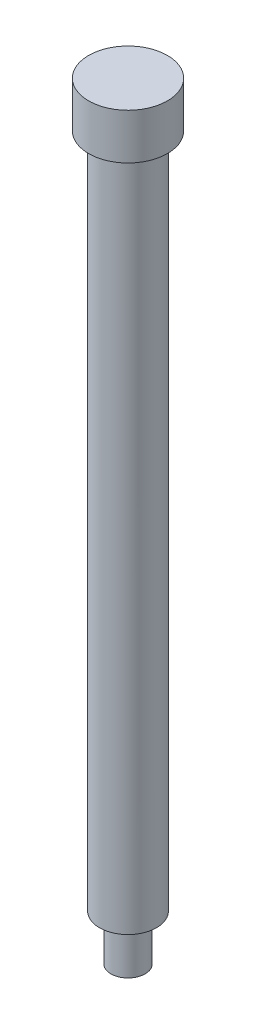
ISO-10303-21;
HEADER;
FILE_DESCRIPTION(('STEP AP214'),'2;1');
FILE_NAME('part.step','',(''),(''),'','','');
FILE_SCHEMA(('AUTOMOTIVE_DESIGN { 1 0 10303 214 1 1 1 1 }'));
ENDSEC;
DATA;
#1=APPLICATION_CONTEXT('core data for automotive mechanical design processes');
#2=APPLICATION_PROTOCOL_DEFINITION('international standard','automotive_design',2000,#1);
#3=PRODUCT_CONTEXT('',#1,'mechanical');
#4=PRODUCT('Part','Part','',(#3));
#5=PRODUCT_RELATED_PRODUCT_CATEGORY('part','',(#4));
#6=PRODUCT_DEFINITION_FORMATION('','',#4);
#7=PRODUCT_DEFINITION_CONTEXT('part definition',#1,'design');
#8=PRODUCT_DEFINITION('design','',#6,#7);
#9=PRODUCT_DEFINITION_SHAPE('','',#8);
#10=(LENGTH_UNIT() NAMED_UNIT(*) SI_UNIT(.MILLI.,.METRE.));
#11=(NAMED_UNIT(*) PLANE_ANGLE_UNIT() SI_UNIT($,.RADIAN.));
#12=(NAMED_UNIT(*) SI_UNIT($,.STERADIAN.) SOLID_ANGLE_UNIT());
#13=UNCERTAINTY_MEASURE_WITH_UNIT(LENGTH_MEASURE(1.E-05),#10,'distance_accuracy_value','');
#14=(GEOMETRIC_REPRESENTATION_CONTEXT(3) GLOBAL_UNCERTAINTY_ASSIGNED_CONTEXT((#13)) GLOBAL_UNIT_ASSIGNED_CONTEXT((#10,
#11,#12)) REPRESENTATION_CONTEXT('',''));
#15=CARTESIAN_POINT('',(0.,0.,0.));
#16=DIRECTION('',(0.,0.,1.));
#17=DIRECTION('',(1.,0.,0.));
#18=AXIS2_PLACEMENT_3D('',#15,#16,#17);
#19=CARTESIAN_POINT('',(0.,310.686117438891,0.));
#20=DIRECTION('',(0.,-1.,0.));
#21=DIRECTION('',(0.,0.,-1.));
#22=AXIS2_PLACEMENT_3D('',#19,#20,#21);
#23=CYLINDRICAL_SURFACE('',#22,7.9375);
#24=CARTESIAN_POINT('',(0.,294.811117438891,0.));
#25=DIRECTION('',(0.,1.,0.));
#26=DIRECTION('',(0.,0.,1.));
#27=AXIS2_PLACEMENT_3D('',#24,#25,#26);
#28=CIRCLE('',#27,7.9375);
#29=CARTESIAN_POINT('',(0.,294.811117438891,7.9375));
#30=VERTEX_POINT('',#29);
#31=EDGE_CURVE('E61',#30,#30,#28,.T.);
#32=ORIENTED_EDGE('',*,*,#31,.T.);
#33=EDGE_LOOP('',(#32));
#34=FACE_BOUND('',#33,.T.);
#35=CARTESIAN_POINT('',(0.,482.771117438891,0.));
#36=DIRECTION('',(0.,-1.,0.));
#37=DIRECTION('',(0.,0.,-1.));
#38=AXIS2_PLACEMENT_3D('',#35,#36,#37);
#39=CIRCLE('',#38,7.9375);
#40=CARTESIAN_POINT('',(0.,482.771117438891,-7.9375));
#41=VERTEX_POINT('',#40);
#42=EDGE_CURVE('E10',#41,#41,#39,.T.);
#43=ORIENTED_EDGE('',*,*,#42,.T.);
#44=EDGE_LOOP('',(#43));
#45=FACE_BOUND('',#44,.T.);
#46=ADVANCED_FACE('F29',(#34,#45),#23,.T.);
#47=CARTESIAN_POINT('',(-10.95375,482.771117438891,0.));
#48=DIRECTION('',(0.,1.,0.));
#49=DIRECTION('',(0.,0.,1.));
#50=AXIS2_PLACEMENT_3D('',#47,#48,#49);
#51=PLANE('',#50);
#52=ORIENTED_EDGE('',*,*,#42,.F.);
#53=EDGE_LOOP('',(#52));
#54=FACE_BOUND('',#53,.T.);
#55=CARTESIAN_POINT('',(0.,482.771117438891,0.));
#56=DIRECTION('',(0.,-1.,0.));
#57=DIRECTION('',(0.,0.,-1.));
#58=AXIS2_PLACEMENT_3D('',#55,#56,#57);
#59=CIRCLE('',#58,10.95375);
#60=CARTESIAN_POINT('',(0.,482.771117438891,-10.95375));
#61=VERTEX_POINT('',#60);
#62=EDGE_CURVE('E36',#61,#61,#59,.T.);
#63=ORIENTED_EDGE('',*,*,#62,.T.);
#64=EDGE_LOOP('',(#63));
#65=FACE_BOUND('',#64,.T.);
#66=ADVANCED_FACE('F101',(#54,#65),#51,.F.);
#67=CARTESIAN_POINT('',(0.,310.686117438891,0.));
#68=DIRECTION('',(0.,-1.,0.));
#69=DIRECTION('',(0.,0.,-1.));
#70=AXIS2_PLACEMENT_3D('',#67,#68,#69);
#71=CYLINDRICAL_SURFACE('',#70,10.95375);
#72=ORIENTED_EDGE('',*,*,#62,.F.);
#73=EDGE_LOOP('',(#72));
#74=FACE_BOUND('',#73,.T.);
#75=CARTESIAN_POINT('',(0.,495.471117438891,0.));
#76=DIRECTION('',(0.,-1.,0.));
#77=DIRECTION('',(0.,0.,-1.));
#78=AXIS2_PLACEMENT_3D('',#75,#76,#77);
#79=CIRCLE('',#78,10.95375);
#80=CARTESIAN_POINT('',(0.,495.471117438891,-10.95375));
#81=VERTEX_POINT('',#80);
#82=EDGE_CURVE('E40',#81,#81,#79,.T.);
#83=ORIENTED_EDGE('',*,*,#82,.T.);
#84=EDGE_LOOP('',(#83));
#85=FACE_BOUND('',#84,.T.);
#86=ADVANCED_FACE('F105',(#74,#85),#71,.T.);
#87=CARTESIAN_POINT('',(-10.95375,495.471117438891,0.));
#88=DIRECTION('',(0.,-1.,0.));
#89=DIRECTION('',(0.,0.,-1.));
#90=AXIS2_PLACEMENT_3D('',#87,#88,#89);
#91=PLANE('',#90);
#92=ORIENTED_EDGE('',*,*,#82,.F.);
#93=EDGE_LOOP('',(#92));
#94=FACE_BOUND('',#93,.T.);
#95=ADVANCED_FACE('F93',(#94),#91,.F.);
#96=CARTESIAN_POINT('',(0.,498.011117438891,0.));
#97=DIRECTION('',(0.,1.,0.));
#98=DIRECTION('',(0.,0.,1.));
#99=AXIS2_PLACEMENT_3D('',#96,#97,#98);
#100=CYLINDRICAL_SURFACE('',#99,4.7625);
#101=CARTESIAN_POINT('',(0.,292.880717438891,0.));
#102=DIRECTION('',(0.,1.,0.));
#103=DIRECTION('',(0.,0.,1.));
#104=AXIS2_PLACEMENT_3D('',#101,#102,#103);
#105=CIRCLE('',#104,4.7625);
#106=CARTESIAN_POINT('',(0.,292.880717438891,4.7625));
#107=VERTEX_POINT('',#106);
#108=EDGE_CURVE('E49',#107,#107,#105,.T.);
#109=ORIENTED_EDGE('',*,*,#108,.F.);
#110=EDGE_LOOP('',(#109));
#111=FACE_BOUND('',#110,.T.);
#112=CARTESIAN_POINT('',(0.,282.111117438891,0.));
#113=DIRECTION('',(0.,1.,0.));
#114=DIRECTION('',(0.,0.,1.));
#115=AXIS2_PLACEMENT_3D('',#112,#113,#114);
#116=CIRCLE('',#115,4.7625);
#117=CARTESIAN_POINT('',(0.,282.111117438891,4.7625));
#118=VERTEX_POINT('',#117);
#119=EDGE_CURVE('E44',#118,#118,#116,.T.);
#120=ORIENTED_EDGE('',*,*,#119,.T.);
#121=EDGE_LOOP('',(#120));
#122=FACE_BOUND('',#121,.T.);
#123=ADVANCED_FACE('F87',(#111,#122),#100,.T.);
#124=CARTESIAN_POINT('',(0.,293.668117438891,0.));
#125=DIRECTION('',(0.,1.,0.));
#126=DIRECTION('',(0.,0.,1.));
#127=AXIS2_PLACEMENT_3D('',#124,#125,#126);
#128=TOROIDAL_SURFACE('',#127,4.7625,0.787399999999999);
#129=CARTESIAN_POINT('',(0.,293.668117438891,0.));
#130=DIRECTION('',(0.,1.,0.));
#131=DIRECTION('',(0.,0.,1.));
#132=AXIS2_PLACEMENT_3D('',#129,#130,#131);
#133=CIRCLE('',#132,3.9751);
#134=CARTESIAN_POINT('',(0.,293.668117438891,3.9751));
#135=VERTEX_POINT('',#134);
#136=EDGE_CURVE('E52',#135,#135,#133,.T.);
#137=ORIENTED_EDGE('',*,*,#136,.F.);
#138=EDGE_LOOP('',(#137));
#139=FACE_BOUND('',#138,.T.);
#140=ORIENTED_EDGE('',*,*,#108,.T.);
#141=EDGE_LOOP('',(#140));
#142=FACE_BOUND('',#141,.T.);
#143=ADVANCED_FACE('F81',(#139,#142),#128,.F.);
#144=CARTESIAN_POINT('',(0.,498.011117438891,0.));
#145=DIRECTION('',(0.,1.,0.));
#146=DIRECTION('',(0.,0.,1.));
#147=AXIS2_PLACEMENT_3D('',#144,#145,#146);
#148=CYLINDRICAL_SURFACE('',#147,3.9751);
#149=CARTESIAN_POINT('',(0.,294.023717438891,0.));
#150=DIRECTION('',(0.,1.,0.));
#151=DIRECTION('',(0.,0.,1.));
#152=AXIS2_PLACEMENT_3D('',#149,#150,#151);
#153=CIRCLE('',#152,3.9751);
#154=CARTESIAN_POINT('',(0.,294.023717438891,3.9751));
#155=VERTEX_POINT('',#154);
#156=EDGE_CURVE('E55',#155,#155,#153,.T.);
#157=ORIENTED_EDGE('',*,*,#156,.F.);
#158=EDGE_LOOP('',(#157));
#159=FACE_BOUND('',#158,.T.);
#160=ORIENTED_EDGE('',*,*,#136,.T.);
#161=EDGE_LOOP('',(#160));
#162=FACE_BOUND('',#161,.T.);
#163=ADVANCED_FACE('F75',(#159,#162),#148,.T.);
#164=CARTESIAN_POINT('',(0.,294.023717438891,0.));
#165=DIRECTION('',(0.,1.,0.));
#166=DIRECTION('',(0.,0.,1.));
#167=AXIS2_PLACEMENT_3D('',#164,#165,#166);
#168=TOROIDAL_SURFACE('',#167,4.7625,0.787399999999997);
#169=CARTESIAN_POINT('',(0.,294.811117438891,0.));
#170=DIRECTION('',(0.,1.,0.));
#171=DIRECTION('',(0.,0.,1.));
#172=AXIS2_PLACEMENT_3D('',#169,#170,#171);
#173=CIRCLE('',#172,4.7625);
#174=CARTESIAN_POINT('',(0.,294.811117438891,4.7625));
#175=VERTEX_POINT('',#174);
#176=EDGE_CURVE('E58',#175,#175,#173,.T.);
#177=ORIENTED_EDGE('',*,*,#176,.F.);
#178=EDGE_LOOP('',(#177));
#179=FACE_BOUND('',#178,.T.);
#180=ORIENTED_EDGE('',*,*,#156,.T.);
#181=EDGE_LOOP('',(#180));
#182=FACE_BOUND('',#181,.T.);
#183=ADVANCED_FACE('F69',(#179,#182),#168,.F.);
#184=CARTESIAN_POINT('',(-4.7625,294.811117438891,0.));
#185=DIRECTION('',(0.,1.,0.));
#186=DIRECTION('',(0.,0.,1.));
#187=AXIS2_PLACEMENT_3D('',#184,#185,#186);
#188=PLANE('',#187);
#189=ORIENTED_EDGE('',*,*,#31,.F.);
#190=EDGE_LOOP('',(#189));
#191=FACE_BOUND('',#190,.T.);
#192=ORIENTED_EDGE('',*,*,#176,.T.);
#193=EDGE_LOOP('',(#192));
#194=FACE_BOUND('',#193,.T.);
#195=ADVANCED_FACE('F66',(#191,#194),#188,.F.);
#196=CARTESIAN_POINT('',(0.,282.111117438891,0.));
#197=DIRECTION('',(0.,1.,0.));
#198=DIRECTION('',(0.,0.,1.));
#199=AXIS2_PLACEMENT_3D('',#196,#197,#198);
#200=PLANE('',#199);
#201=ORIENTED_EDGE('',*,*,#119,.F.);
#202=EDGE_LOOP('',(#201));
#203=FACE_BOUND('',#202,.T.);
#204=ADVANCED_FACE('F31',(#203),#200,.F.);
#205=CLOSED_SHELL('',(#46,#66,#86,#95,#123,#143,#163,#183,#195,#204));
#206=MANIFOLD_SOLID_BREP('B2',#205);
#207=ADVANCED_BREP_SHAPE_REPRESENTATION('',(#18,#206),#14);
#208=SHAPE_DEFINITION_REPRESENTATION(#9,#207);
ENDSEC;
END-ISO-10303-21;
